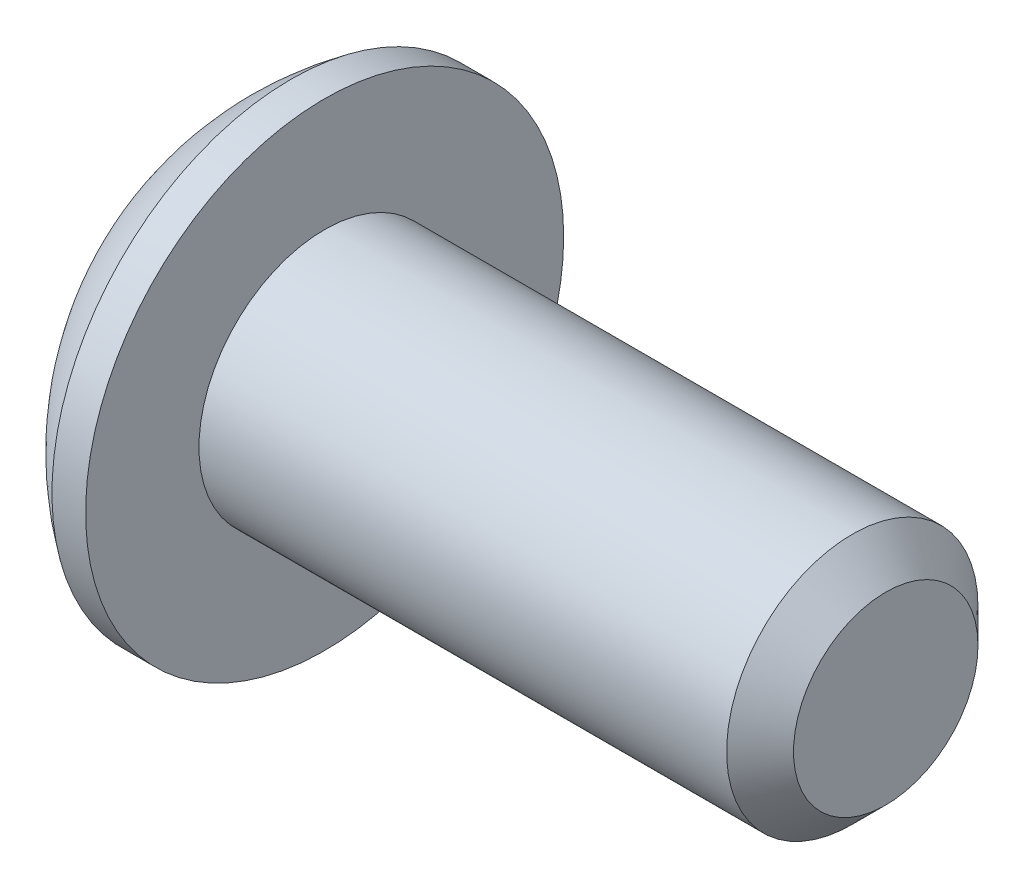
ISO-10303-21;
HEADER;
FILE_DESCRIPTION(('STEP AP214'),'2;1');
FILE_NAME('part.step','',(''),(''),'','','');
FILE_SCHEMA(('AUTOMOTIVE_DESIGN { 1 0 10303 214 1 1 1 1 }'));
ENDSEC;
DATA;
#1=APPLICATION_CONTEXT('core data for automotive mechanical design processes');
#2=APPLICATION_PROTOCOL_DEFINITION('international standard','automotive_design',2000,#1);
#3=PRODUCT_CONTEXT('',#1,'mechanical');
#4=PRODUCT('Part','Part','',(#3));
#5=PRODUCT_RELATED_PRODUCT_CATEGORY('part','',(#4));
#6=PRODUCT_DEFINITION_FORMATION('','',#4);
#7=PRODUCT_DEFINITION_CONTEXT('part definition',#1,'design');
#8=PRODUCT_DEFINITION('design','',#6,#7);
#9=PRODUCT_DEFINITION_SHAPE('','',#8);
#10=(LENGTH_UNIT() NAMED_UNIT(*) SI_UNIT(.MILLI.,.METRE.));
#11=(NAMED_UNIT(*) PLANE_ANGLE_UNIT() SI_UNIT($,.RADIAN.));
#12=(NAMED_UNIT(*) SI_UNIT($,.STERADIAN.) SOLID_ANGLE_UNIT());
#13=UNCERTAINTY_MEASURE_WITH_UNIT(LENGTH_MEASURE(1.E-05),#10,'distance_accuracy_value','');
#14=(GEOMETRIC_REPRESENTATION_CONTEXT(3) GLOBAL_UNCERTAINTY_ASSIGNED_CONTEXT((#13)) GLOBAL_UNIT_ASSIGNED_CONTEXT((#10,
#11,#12)) REPRESENTATION_CONTEXT('',''));
#15=CARTESIAN_POINT('',(0.,0.,0.));
#16=DIRECTION('',(0.,0.,1.));
#17=DIRECTION('',(1.,0.,0.));
#18=AXIS2_PLACEMENT_3D('',#15,#16,#17);
#19=CARTESIAN_POINT('',(0.,0.,0.));
#20=DIRECTION('',(-1.,0.,0.));
#21=DIRECTION('',(0.,0.,1.));
#22=AXIS2_PLACEMENT_3D('',#19,#20,#21);
#23=PLANE('',#22);
#24=DIRECTION('',(0.,0.5,0.866025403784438));
#25=VECTOR('',#24,1.);
#26=CARTESIAN_POINT('',(0.,-0.909211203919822,0.));
#27=LINE('',#26,#25);
#28=CARTESIAN_POINT('',(0.,-0.909211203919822,0.));
#29=VERTEX_POINT('',#28);
#30=CARTESIAN_POINT('',(0.,-0.454605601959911,0.7874));
#31=VERTEX_POINT('',#30);
#32=EDGE_CURVE('E45',#29,#31,#27,.T.);
#33=ORIENTED_EDGE('',*,*,#32,.F.);
#34=DIRECTION('',(0.,-0.5,0.866025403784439));
#35=VECTOR('',#34,1.);
#36=CARTESIAN_POINT('',(0.,-0.454605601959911,-0.7874));
#37=LINE('',#36,#35);
#38=CARTESIAN_POINT('',(0.,-0.454605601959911,-0.7874));
#39=VERTEX_POINT('',#38);
#40=EDGE_CURVE('E128',#39,#29,#37,.T.);
#41=ORIENTED_EDGE('',*,*,#40,.F.);
#42=DIRECTION('',(0.,-1.,0.));
#43=VECTOR('',#42,1.);
#44=CARTESIAN_POINT('',(0.,0.454605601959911,-0.7874));
#45=LINE('',#44,#43);
#46=CARTESIAN_POINT('',(0.,0.454605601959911,-0.7874));
#47=VERTEX_POINT('',#46);
#48=EDGE_CURVE('E126',#47,#39,#45,.T.);
#49=ORIENTED_EDGE('',*,*,#48,.F.);
#50=DIRECTION('',(0.,-0.5,-0.866025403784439));
#51=VECTOR('',#50,1.);
#52=CARTESIAN_POINT('',(0.,0.909211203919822,0.));
#53=LINE('',#52,#51);
#54=CARTESIAN_POINT('',(0.,0.909211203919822,0.));
#55=VERTEX_POINT('',#54);
#56=EDGE_CURVE('E93',#55,#47,#53,.T.);
#57=ORIENTED_EDGE('',*,*,#56,.F.);
#58=DIRECTION('',(0.,0.5,-0.866025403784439));
#59=VECTOR('',#58,1.);
#60=CARTESIAN_POINT('',(0.,0.454605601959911,0.7874));
#61=LINE('',#60,#59);
#62=CARTESIAN_POINT('',(0.,0.454605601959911,0.7874));
#63=VERTEX_POINT('',#62);
#64=EDGE_CURVE('E122',#63,#55,#61,.T.);
#65=ORIENTED_EDGE('',*,*,#64,.F.);
#66=DIRECTION('',(0.,1.,0.));
#67=VECTOR('',#66,1.);
#68=CARTESIAN_POINT('',(0.,-0.454605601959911,0.7874));
#69=LINE('',#68,#67);
#70=EDGE_CURVE('E119',#31,#63,#69,.T.);
#71=ORIENTED_EDGE('',*,*,#70,.F.);
#72=EDGE_LOOP('',(#33,#41,#49,#57,#65,#71));
#73=FACE_BOUND('',#72,.T.);
#74=CARTESIAN_POINT('',(0.,0.,0.));
#75=DIRECTION('',(1.,0.,0.));
#76=DIRECTION('',(0.,0.,-1.));
#77=AXIS2_PLACEMENT_3D('',#74,#75,#76);
#78=CIRCLE('',#77,1.35255);
#79=CARTESIAN_POINT('',(0.,1.35255,0.));
#80=VERTEX_POINT('',#79);
#81=EDGE_CURVE('E11',#80,#80,#78,.T.);
#82=ORIENTED_EDGE('',*,*,#81,.F.);
#83=EDGE_LOOP('',(#82));
#84=FACE_BOUND('',#83,.T.);
#85=ADVANCED_FACE('F31',(#73,#84),#23,.T.);
#86=CARTESIAN_POINT('',(3.01413934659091,0.,0.));
#87=DIRECTION('',(1.,0.,0.));
#88=DIRECTION('',(0.,1.,0.));
#89=AXIS2_PLACEMENT_3D('',#86,#87,#88);
#90=SPHERICAL_SURFACE('',#89,3.30369906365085);
#91=CARTESIAN_POINT('',(1.11760000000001,0.,0.));
#92=DIRECTION('',(1.,0.,0.));
#93=DIRECTION('',(0.,0.,-1.));
#94=AXIS2_PLACEMENT_3D('',#91,#92,#93);
#95=CIRCLE('',#94,2.70510000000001);
#96=CARTESIAN_POINT('',(1.11760000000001,2.70510000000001,0.));
#97=VERTEX_POINT('',#96);
#98=EDGE_CURVE('E38',#97,#97,#95,.T.);
#99=CARTESIAN_POINT('',(0.,1.35255,0.));
#100=CARTESIAN_POINT('',(0.00757331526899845,1.36942706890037,0.));
#101=CARTESIAN_POINT('',(0.0152884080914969,1.38624051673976,0.));
#102=CARTESIAN_POINT('',(0.0309999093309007,1.41973545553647,0.));
#103=CARTESIAN_POINT('',(0.0389963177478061,1.43641694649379,0.));
#104=CARTESIAN_POINT('',(0.0552682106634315,1.46964325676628,0.));
#105=CARTESIAN_POINT('',(0.0635436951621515,1.48618807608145,0.));
#106=CARTESIAN_POINT('',(0.080371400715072,1.51913637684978,0.));
#107=CARTESIAN_POINT('',(0.0889236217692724,1.53553985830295,0.));
#108=CARTESIAN_POINT('',(0.106302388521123,1.56820085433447,0.));
#109=CARTESIAN_POINT('',(0.115128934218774,1.58445836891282,0.));
#110=CARTESIAN_POINT('',(0.133053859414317,1.61682284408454,0.));
#111=CARTESIAN_POINT('',(0.14215223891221,1.63292980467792,0.));
#112=CARTESIAN_POINT('',(0.160618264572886,1.66498862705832,0.));
#113=CARTESIAN_POINT('',(0.169985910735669,1.68094048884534,0.));
#114=CARTESIAN_POINT('',(0.188987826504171,1.71268461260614,0.));
#115=CARTESIAN_POINT('',(0.19862209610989,1.72847687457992,0.));
#116=CARTESIAN_POINT('',(0.218154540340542,1.75989734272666,0.));
#117=CARTESIAN_POINT('',(0.228052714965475,1.77552554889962,0.));
#118=CARTESIAN_POINT('',(0.24811017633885,1.80661349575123,0.));
#119=CARTESIAN_POINT('',(0.258269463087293,1.82207323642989,0.));
#120=CARTESIAN_POINT('',(0.278846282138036,1.85281989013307,0.));
#121=CARTESIAN_POINT('',(0.289263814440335,1.8681068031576,0.));
#122=CARTESIAN_POINT('',(0.310354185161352,1.89850348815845,0.));
#123=CARTESIAN_POINT('',(0.321027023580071,1.91361326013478,0.));
#124=CARTESIAN_POINT('',(0.342624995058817,1.94365139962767,0.));
#125=CARTESIAN_POINT('',(0.353550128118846,1.95857976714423,0.));
#126=CARTESIAN_POINT('',(0.375649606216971,1.98825088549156,0.));
#127=CARTESIAN_POINT('',(0.386823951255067,2.00299363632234,0.));
#128=CARTESIAN_POINT('',(0.40941870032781,2.03228936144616,0.));
#129=CARTESIAN_POINT('',(0.420839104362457,2.04684233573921,0.));
#130=CARTESIAN_POINT('',(0.443922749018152,2.07575440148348,0.));
#131=CARTESIAN_POINT('',(0.4555859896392,2.09011349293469,0.));
#132=CARTESIAN_POINT('',(0.479152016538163,2.11863374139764,0.));
#133=CARTESIAN_POINT('',(0.491054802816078,2.13279489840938,0.));
#134=CARTESIAN_POINT('',(0.515096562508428,2.16091528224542,0.));
#135=CARTESIAN_POINT('',(0.527235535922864,2.17487450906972,0.));
#136=CARTESIAN_POINT('',(0.55174624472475,2.20258709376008,0.));
#137=CARTESIAN_POINT('',(0.564117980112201,2.21634045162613,0.));
#138=CARTESIAN_POINT('',(0.589090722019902,2.24363741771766,0.));
#139=CARTESIAN_POINT('',(0.601691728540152,2.25718102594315,0.));
#140=CARTESIAN_POINT('',(0.627119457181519,2.28405467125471,0.));
#141=CARTESIAN_POINT('',(0.639946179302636,2.2973847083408,0.));
#142=CARTESIAN_POINT('',(0.665821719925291,2.32382745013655,0.));
#143=CARTESIAN_POINT('',(0.678870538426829,2.33694015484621,0.));
#144=CARTESIAN_POINT('',(0.705186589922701,2.36294453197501,0.));
#145=CARTESIAN_POINT('',(0.718453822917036,2.37583620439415,0.));
#146=CARTESIAN_POINT('',(0.745202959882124,2.40139487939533,0.));
#147=CARTESIAN_POINT('',(0.758684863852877,2.41406188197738,0.));
#148=CARTESIAN_POINT('',(0.785859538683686,2.43916764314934,0.));
#149=CARTESIAN_POINT('',(0.799552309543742,2.45160640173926,0.));
#150=CARTESIAN_POINT('',(0.827144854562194,2.47625216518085,0.));
#151=CARTESIAN_POINT('',(0.84104462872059,2.48845917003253,0.));
#152=CARTESIAN_POINT('',(0.869047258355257,2.51263798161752,0.));
#153=CARTESIAN_POINT('',(0.883150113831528,2.52460978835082,0.));
#154=CARTESIAN_POINT('',(0.911554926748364,2.54831482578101,0.));
#155=CARTESIAN_POINT('',(0.92585688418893,2.56004805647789,0.));
#156=CARTESIAN_POINT('',(0.954655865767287,2.58327263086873,0.));
#157=CARTESIAN_POINT('',(0.969152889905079,2.59476397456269,0.));
#158=CARTESIAN_POINT('',(0.998337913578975,2.61750153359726,0.));
#159=CARTESIAN_POINT('',(1.01302591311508,2.62874774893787,0.));
#160=CARTESIAN_POINT('',(1.04258874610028,2.65099187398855,0.));
#161=CARTESIAN_POINT('',(1.05746357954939,2.66198978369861,0.));
#162=CARTESIAN_POINT('',(1.08739587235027,2.6837342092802,0.));
#163=CARTESIAN_POINT('',(1.10245333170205,2.69448072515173,0.));
#164=CARTESIAN_POINT('',(1.11760000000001,2.70510000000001,0.));
#165=B_SPLINE_CURVE_WITH_KNOTS('',3,(#99,#100,#101,#102,#103,#104,#105,#106,#107,#108,#109,#110,
#111,#112,#113,#114,#115,#116,#117,#118,#119,#120,#121,#122,#123,#124,#125,#126,#127,#128,#129,
#130,#131,#132,#133,#134,#135,#136,#137,#138,#139,#140,#141,#142,#143,#144,#145,#146,#147,#148,
#149,#150,#151,#152,#153,#154,#155,#156,#157,#158,#159,#160,#161,#162,#163,#164),.UNSPECIFIED.,
.F.,.F.,(4,2,2,2,2,2,2,2,2,2,2,2,2,2,2,2,2,2,2,2,2,2,2,2,2,2,2,2,2,2,2,2,4),(0.,
0.0554945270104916,0.110989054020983,0.166483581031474,0.221978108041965,0.277472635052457,
0.332967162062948,0.38846168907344,0.44395621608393,0.499450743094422,0.554945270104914,
0.610439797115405,0.665934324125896,0.721428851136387,0.776923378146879,0.832417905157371,
0.887912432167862,0.943406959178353,0.998901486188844,1.05439601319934,1.10989054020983,
1.16538506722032,1.22087959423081,1.2763741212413,1.33186864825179,1.38736317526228,
1.44285770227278,1.49835222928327,1.55384675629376,1.60934128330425,1.66483581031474,
1.72033033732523,1.77582486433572),.UNSPECIFIED.);
#166=EDGE_CURVE('BSEAM154',#80,#97,#165,.T.);
#167=ORIENTED_EDGE('',*,*,#81,.T.);
#168=ORIENTED_EDGE('',*,*,#98,.F.);
#169=ORIENTED_EDGE('',*,*,#166,.T.);
#170=ORIENTED_EDGE('',*,*,#166,.F.);
#171=EDGE_LOOP('',(#167,#169,#168,#170));
#172=FACE_BOUND('',#171,.T.);
#173=ADVANCED_FACE('F154',(#172),#90,.T.);
#174=CARTESIAN_POINT('',(7.84860000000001,0.,0.));
#175=DIRECTION('',(1.,0.,0.));
#176=DIRECTION('',(0.,0.,-1.));
#177=AXIS2_PLACEMENT_3D('',#174,#175,#176);
#178=CYLINDRICAL_SURFACE('',#177,2.70510000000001);
#179=ORIENTED_EDGE('',*,*,#98,.T.);
#180=EDGE_LOOP('',(#179));
#181=FACE_BOUND('',#180,.T.);
#182=CARTESIAN_POINT('',(1.49860000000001,0.,0.));
#183=DIRECTION('',(1.,0.,0.));
#184=DIRECTION('',(0.,0.,-1.));
#185=AXIS2_PLACEMENT_3D('',#182,#183,#184);
#186=CIRCLE('',#185,2.70510000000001);
#187=CARTESIAN_POINT('',(1.49860000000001,0.,-2.70510000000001));
#188=VERTEX_POINT('',#187);
#189=EDGE_CURVE('E146',#188,#188,#186,.T.);
#190=ORIENTED_EDGE('',*,*,#189,.F.);
#191=EDGE_LOOP('',(#190));
#192=FACE_BOUND('',#191,.T.);
#193=ADVANCED_FACE('F151',(#181,#192),#178,.T.);
#194=CARTESIAN_POINT('',(1.49860000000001,1.42240000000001,0.));
#195=DIRECTION('',(1.,0.,0.));
#196=DIRECTION('',(0.,0.,-1.));
#197=AXIS2_PLACEMENT_3D('',#194,#195,#196);
#198=PLANE('',#197);
#199=ORIENTED_EDGE('',*,*,#189,.T.);
#200=EDGE_LOOP('',(#199));
#201=FACE_BOUND('',#200,.T.);
#202=CARTESIAN_POINT('',(1.49860000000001,0.,0.));
#203=DIRECTION('',(1.,0.,0.));
#204=DIRECTION('',(0.,0.,-1.));
#205=AXIS2_PLACEMENT_3D('',#202,#203,#204);
#206=CIRCLE('',#205,1.42240000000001);
#207=CARTESIAN_POINT('',(1.49860000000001,0.,-1.42240000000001));
#208=VERTEX_POINT('',#207);
#209=EDGE_CURVE('E143',#208,#208,#206,.T.);
#210=ORIENTED_EDGE('',*,*,#209,.F.);
#211=EDGE_LOOP('',(#210));
#212=FACE_BOUND('',#211,.T.);
#213=ADVANCED_FACE('F161',(#201,#212),#198,.T.);
#214=CARTESIAN_POINT('',(7.84860000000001,0.,0.));
#215=DIRECTION('',(1.,0.,0.));
#216=DIRECTION('',(0.,0.,-1.));
#217=AXIS2_PLACEMENT_3D('',#214,#215,#216);
#218=CYLINDRICAL_SURFACE('',#217,1.42240000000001);
#219=ORIENTED_EDGE('',*,*,#209,.T.);
#220=EDGE_LOOP('',(#219));
#221=FACE_BOUND('',#220,.T.);
#222=CARTESIAN_POINT('',(7.47014000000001,0.,0.));
#223=DIRECTION('',(1.,0.,0.));
#224=DIRECTION('',(0.,0.,-1.));
#225=AXIS2_PLACEMENT_3D('',#222,#223,#224);
#226=CIRCLE('',#225,1.42240000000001);
#227=CARTESIAN_POINT('',(7.47014000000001,0.,-1.42240000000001));
#228=VERTEX_POINT('',#227);
#229=EDGE_CURVE('E140',#228,#228,#226,.T.);
#230=ORIENTED_EDGE('',*,*,#229,.F.);
#231=EDGE_LOOP('',(#230));
#232=FACE_BOUND('',#231,.T.);
#233=ADVANCED_FACE('F167',(#221,#232),#218,.T.);
#234=CARTESIAN_POINT('',(7.84860000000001,0.,0.));
#235=DIRECTION('',(-1.,0.,0.));
#236=DIRECTION('',(0.,0.,1.));
#237=AXIS2_PLACEMENT_3D('',#234,#235,#236);
#238=CONICAL_SURFACE('',#237,1.04394000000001,0.785398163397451);
#239=ORIENTED_EDGE('',*,*,#229,.T.);
#240=EDGE_LOOP('',(#239));
#241=FACE_BOUND('',#240,.T.);
#242=CARTESIAN_POINT('',(7.84860000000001,0.,0.));
#243=DIRECTION('',(1.,0.,0.));
#244=DIRECTION('',(0.,0.,-1.));
#245=AXIS2_PLACEMENT_3D('',#242,#243,#244);
#246=CIRCLE('',#245,1.04394000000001);
#247=CARTESIAN_POINT('',(7.84860000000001,0.,-1.04394000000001));
#248=VERTEX_POINT('',#247);
#249=EDGE_CURVE('E132',#248,#248,#246,.T.);
#250=ORIENTED_EDGE('',*,*,#249,.F.);
#251=EDGE_LOOP('',(#250));
#252=FACE_BOUND('',#251,.T.);
#253=ADVANCED_FACE('F171',(#241,#252),#238,.T.);
#254=CARTESIAN_POINT('',(7.84860000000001,0.,0.));
#255=DIRECTION('',(1.,0.,0.));
#256=DIRECTION('',(0.,0.,-1.));
#257=AXIS2_PLACEMENT_3D('',#254,#255,#256);
#258=PLANE('',#257);
#259=ORIENTED_EDGE('',*,*,#249,.T.);
#260=EDGE_LOOP('',(#259));
#261=FACE_BOUND('',#260,.T.);
#262=ADVANCED_FACE('F175',(#261),#258,.T.);
#263=CARTESIAN_POINT('',(0.889,-0.909211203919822,0.));
#264=DIRECTION('',(0.,-0.866025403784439,0.5));
#265=DIRECTION('',(0.,-0.5,-0.866025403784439));
#266=AXIS2_PLACEMENT_3D('',#263,#264,#265);
#267=PLANE('',#266);
#268=ORIENTED_EDGE('',*,*,#32,.T.);
#269=DIRECTION('',(-1.,0.,0.));
#270=VECTOR('',#269,1.);
#271=CARTESIAN_POINT('',(0.889,-0.454605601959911,0.7874));
#272=LINE('',#271,#270);
#273=CARTESIAN_POINT('',(0.889,-0.454605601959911,0.7874));
#274=VERTEX_POINT('',#273);
#275=EDGE_CURVE('E75',#274,#31,#272,.T.);
#276=ORIENTED_EDGE('',*,*,#275,.F.);
#277=DIRECTION('',(0.,0.5,0.866025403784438));
#278=VECTOR('',#277,1.);
#279=CARTESIAN_POINT('',(0.889,-0.909211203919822,0.));
#280=LINE('',#279,#278);
#281=CARTESIAN_POINT('',(0.889,-0.909211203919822,0.));
#282=VERTEX_POINT('',#281);
#283=EDGE_CURVE('E130',#282,#274,#280,.T.);
#284=ORIENTED_EDGE('',*,*,#283,.F.);
#285=DIRECTION('',(-1.,0.,0.));
#286=VECTOR('',#285,1.);
#287=CARTESIAN_POINT('',(0.889,-0.909211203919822,0.));
#288=LINE('',#287,#286);
#289=EDGE_CURVE('E53',#282,#29,#288,.T.);
#290=ORIENTED_EDGE('',*,*,#289,.T.);
#291=EDGE_LOOP('',(#268,#276,#284,#290));
#292=FACE_BOUND('',#291,.T.);
#293=ADVANCED_FACE('F179',(#292),#267,.F.);
#294=CARTESIAN_POINT('',(0.889,-0.454605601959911,-0.7874));
#295=DIRECTION('',(0.,-0.866025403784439,-0.5));
#296=DIRECTION('',(0.,0.5,-0.866025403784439));
#297=AXIS2_PLACEMENT_3D('',#294,#295,#296);
#298=PLANE('',#297);
#299=ORIENTED_EDGE('',*,*,#40,.T.);
#300=ORIENTED_EDGE('',*,*,#289,.F.);
#301=DIRECTION('',(0.,-0.5,0.866025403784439));
#302=VECTOR('',#301,1.);
#303=CARTESIAN_POINT('',(0.889,-0.454605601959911,-0.7874));
#304=LINE('',#303,#302);
#305=CARTESIAN_POINT('',(0.889,-0.454605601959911,-0.7874));
#306=VERTEX_POINT('',#305);
#307=EDGE_CURVE('E105',#306,#282,#304,.T.);
#308=ORIENTED_EDGE('',*,*,#307,.F.);
#309=DIRECTION('',(-1.,0.,0.));
#310=VECTOR('',#309,1.);
#311=CARTESIAN_POINT('',(0.889,-0.454605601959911,-0.7874));
#312=LINE('',#311,#310);
#313=EDGE_CURVE('E97',#306,#39,#312,.T.);
#314=ORIENTED_EDGE('',*,*,#313,.T.);
#315=EDGE_LOOP('',(#299,#300,#308,#314));
#316=FACE_BOUND('',#315,.T.);
#317=ADVANCED_FACE('F183',(#316),#298,.F.);
#318=CARTESIAN_POINT('',(0.889,0.454605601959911,-0.7874));
#319=DIRECTION('',(0.,0.,-1.));
#320=DIRECTION('',(-1.,0.,0.));
#321=AXIS2_PLACEMENT_3D('',#318,#319,#320);
#322=PLANE('',#321);
#323=ORIENTED_EDGE('',*,*,#48,.T.);
#324=ORIENTED_EDGE('',*,*,#313,.F.);
#325=DIRECTION('',(0.,-1.,0.));
#326=VECTOR('',#325,1.);
#327=CARTESIAN_POINT('',(0.889,0.454605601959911,-0.7874));
#328=LINE('',#327,#326);
#329=CARTESIAN_POINT('',(0.889,0.454605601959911,-0.7874));
#330=VERTEX_POINT('',#329);
#331=EDGE_CURVE('E101',#330,#306,#328,.T.);
#332=ORIENTED_EDGE('',*,*,#331,.F.);
#333=DIRECTION('',(-1.,0.,0.));
#334=VECTOR('',#333,1.);
#335=CARTESIAN_POINT('',(0.889,0.454605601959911,-0.7874));
#336=LINE('',#335,#334);
#337=EDGE_CURVE('E86',#330,#47,#336,.T.);
#338=ORIENTED_EDGE('',*,*,#337,.T.);
#339=EDGE_LOOP('',(#323,#324,#332,#338));
#340=FACE_BOUND('',#339,.T.);
#341=ADVANCED_FACE('F102',(#340),#322,.F.);
#342=CARTESIAN_POINT('',(0.889,0.909211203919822,0.));
#343=DIRECTION('',(0.,0.866025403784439,-0.5));
#344=DIRECTION('',(0.,0.5,0.866025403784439));
#345=AXIS2_PLACEMENT_3D('',#342,#343,#344);
#346=PLANE('',#345);
#347=ORIENTED_EDGE('',*,*,#56,.T.);
#348=ORIENTED_EDGE('',*,*,#337,.F.);
#349=DIRECTION('',(0.,-0.5,-0.866025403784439));
#350=VECTOR('',#349,1.);
#351=CARTESIAN_POINT('',(0.889,0.909211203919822,0.));
#352=LINE('',#351,#350);
#353=CARTESIAN_POINT('',(0.889,0.909211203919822,0.));
#354=VERTEX_POINT('',#353);
#355=EDGE_CURVE('E90',#354,#330,#352,.T.);
#356=ORIENTED_EDGE('',*,*,#355,.F.);
#357=DIRECTION('',(-1.,0.,0.));
#358=VECTOR('',#357,1.);
#359=CARTESIAN_POINT('',(0.889,0.909211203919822,0.));
#360=LINE('',#359,#358);
#361=EDGE_CURVE('E98',#354,#55,#360,.T.);
#362=ORIENTED_EDGE('',*,*,#361,.T.);
#363=EDGE_LOOP('',(#347,#348,#356,#362));
#364=FACE_BOUND('',#363,.T.);
#365=ADVANCED_FACE('F88',(#364),#346,.F.);
#366=CARTESIAN_POINT('',(0.889,0.454605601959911,0.7874));
#367=DIRECTION('',(0.,0.866025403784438,0.5));
#368=DIRECTION('',(0.,-0.5,0.866025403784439));
#369=AXIS2_PLACEMENT_3D('',#366,#367,#368);
#370=PLANE('',#369);
#371=ORIENTED_EDGE('',*,*,#64,.T.);
#372=ORIENTED_EDGE('',*,*,#361,.F.);
#373=DIRECTION('',(0.,0.5,-0.866025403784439));
#374=VECTOR('',#373,1.);
#375=CARTESIAN_POINT('',(0.889,0.454605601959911,0.7874));
#376=LINE('',#375,#374);
#377=CARTESIAN_POINT('',(0.889,0.454605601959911,0.7874));
#378=VERTEX_POINT('',#377);
#379=EDGE_CURVE('E111',#378,#354,#376,.T.);
#380=ORIENTED_EDGE('',*,*,#379,.F.);
#381=DIRECTION('',(-1.,0.,0.));
#382=VECTOR('',#381,1.);
#383=CARTESIAN_POINT('',(0.889,0.454605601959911,0.7874));
#384=LINE('',#383,#382);
#385=EDGE_CURVE('E135',#378,#63,#384,.T.);
#386=ORIENTED_EDGE('',*,*,#385,.T.);
#387=EDGE_LOOP('',(#371,#372,#380,#386));
#388=FACE_BOUND('',#387,.T.);
#389=ADVANCED_FACE('F187',(#388),#370,.F.);
#390=CARTESIAN_POINT('',(0.889,-0.454605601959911,0.7874));
#391=DIRECTION('',(0.,0.,1.));
#392=DIRECTION('',(1.,0.,0.));
#393=AXIS2_PLACEMENT_3D('',#390,#391,#392);
#394=PLANE('',#393);
#395=ORIENTED_EDGE('',*,*,#70,.T.);
#396=ORIENTED_EDGE('',*,*,#385,.F.);
#397=DIRECTION('',(0.,1.,0.));
#398=VECTOR('',#397,1.);
#399=CARTESIAN_POINT('',(0.889,-0.454605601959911,0.7874));
#400=LINE('',#399,#398);
#401=EDGE_CURVE('E113',#274,#378,#400,.T.);
#402=ORIENTED_EDGE('',*,*,#401,.F.);
#403=ORIENTED_EDGE('',*,*,#275,.T.);
#404=EDGE_LOOP('',(#395,#396,#402,#403));
#405=FACE_BOUND('',#404,.T.);
#406=ADVANCED_FACE('F184',(#405),#394,.F.);
#407=CARTESIAN_POINT('',(0.889,-0.454605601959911,0.7874));
#408=DIRECTION('',(-1.,0.,0.));
#409=DIRECTION('',(0.,0.,1.));
#410=AXIS2_PLACEMENT_3D('',#407,#408,#409);
#411=PLANE('',#410);
#412=ORIENTED_EDGE('',*,*,#283,.T.);
#413=ORIENTED_EDGE('',*,*,#401,.T.);
#414=ORIENTED_EDGE('',*,*,#379,.T.);
#415=ORIENTED_EDGE('',*,*,#355,.T.);
#416=ORIENTED_EDGE('',*,*,#331,.T.);
#417=ORIENTED_EDGE('',*,*,#307,.T.);
#418=EDGE_LOOP('',(#412,#413,#414,#415,#416,#417));
#419=FACE_BOUND('',#418,.T.);
#420=ADVANCED_FACE('F108',(#419),#411,.T.);
#421=CLOSED_SHELL('',(#85,#173,#193,#213,#233,#253,#262,#293,#317,#341,#365,#389,#406,#420));
#422=MANIFOLD_SOLID_BREP('B2',#421);
#423=ADVANCED_BREP_SHAPE_REPRESENTATION('',(#18,#422),#14);
#424=SHAPE_DEFINITION_REPRESENTATION(#9,#423);
ENDSEC;
END-ISO-10303-21;
